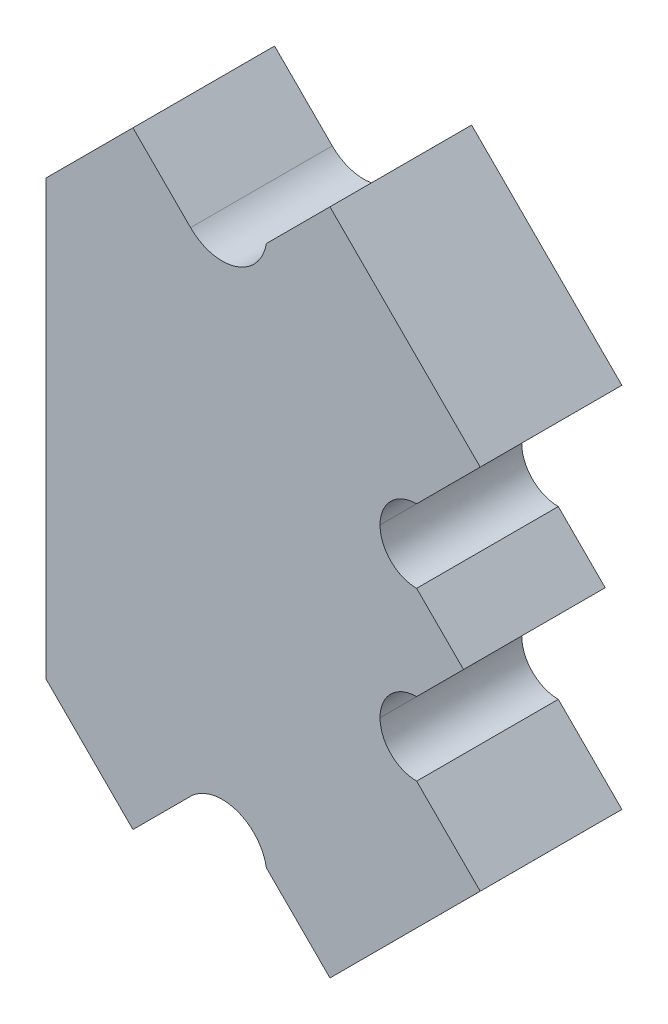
ISO-10303-21;
HEADER;
FILE_DESCRIPTION(('STEP AP214'),'2;1');
FILE_NAME('part.step','',(''),(''),'','','');
FILE_SCHEMA(('AUTOMOTIVE_DESIGN { 1 0 10303 214 1 1 1 1 }'));
ENDSEC;
DATA;
#1=APPLICATION_CONTEXT('core data for automotive mechanical design processes');
#2=APPLICATION_PROTOCOL_DEFINITION('international standard','automotive_design',2000,#1);
#3=PRODUCT_CONTEXT('',#1,'mechanical');
#4=PRODUCT('Part','Part','',(#3));
#5=PRODUCT_RELATED_PRODUCT_CATEGORY('part','',(#4));
#6=PRODUCT_DEFINITION_FORMATION('','',#4);
#7=PRODUCT_DEFINITION_CONTEXT('part definition',#1,'design');
#8=PRODUCT_DEFINITION('design','',#6,#7);
#9=PRODUCT_DEFINITION_SHAPE('','',#8);
#10=(LENGTH_UNIT() NAMED_UNIT(*) SI_UNIT(.MILLI.,.METRE.));
#11=(NAMED_UNIT(*) PLANE_ANGLE_UNIT() SI_UNIT($,.RADIAN.));
#12=(NAMED_UNIT(*) SI_UNIT($,.STERADIAN.) SOLID_ANGLE_UNIT());
#13=UNCERTAINTY_MEASURE_WITH_UNIT(LENGTH_MEASURE(1.E-05),#10,'distance_accuracy_value','');
#14=(GEOMETRIC_REPRESENTATION_CONTEXT(3) GLOBAL_UNCERTAINTY_ASSIGNED_CONTEXT((#13)) GLOBAL_UNIT_ASSIGNED_CONTEXT((#10,
#11,#12)) REPRESENTATION_CONTEXT('',''));
#15=CARTESIAN_POINT('',(0.,0.,0.));
#16=DIRECTION('',(0.,0.,1.));
#17=DIRECTION('',(1.,0.,0.));
#18=AXIS2_PLACEMENT_3D('',#15,#16,#17);
#19=CARTESIAN_POINT('',(2341.95158805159,77.6159460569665,6.));
#20=CARTESIAN_POINT('',(2341.5645384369,77.5498635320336,6.));
#21=CARTESIAN_POINT('',(2341.20755201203,77.3652451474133,6.));
#22=CARTESIAN_POINT('',(2340.9299222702,77.0875834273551,6.));
#23=B_SPLINE_CURVE_WITH_KNOTS('',3,(#19,#20,#21,#22),.UNSPECIFIED.,.F.,.F.,(4,4),(18.,19.),.UNSPECIFIED.);
#24=DIRECTION('',(0.,0.,-1.));
#25=VECTOR('',#24,1.);
#26=SURFACE_OF_LINEAR_EXTRUSION('',#23,#25);
#27=CARTESIAN_POINT('',(2341.95158805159,77.6159460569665,0.));
#28=CARTESIAN_POINT('',(2341.5645384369,77.5498635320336,0.));
#29=CARTESIAN_POINT('',(2341.20755201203,77.3652451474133,0.));
#30=CARTESIAN_POINT('',(2340.9299222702,77.0875834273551,0.));
#31=B_SPLINE_CURVE_WITH_KNOTS('',3,(#27,#28,#29,#30),.UNSPECIFIED.,.F.,.F.,(4,4),(18.,19.),.UNSPECIFIED.);
#32=CARTESIAN_POINT('',(2341.95158805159,77.6159460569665,0.));
#33=VERTEX_POINT('',#32);
#34=CARTESIAN_POINT('',(2340.9299222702,77.0875834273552,0.));
#35=VERTEX_POINT('',#34);
#36=EDGE_CURVE('E208',#33,#35,#31,.T.);
#37=ORIENTED_EDGE('',*,*,#36,.F.);
#38=DIRECTION('',(0.,0.,-1.));
#39=VECTOR('',#38,1.);
#40=CARTESIAN_POINT('',(2341.95158805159,77.6159460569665,6.));
#41=LINE('',#40,#39);
#42=CARTESIAN_POINT('',(2341.95158805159,77.6159460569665,6.));
#43=VERTEX_POINT('',#42);
#44=EDGE_CURVE('E11',#43,#33,#41,.T.);
#45=ORIENTED_EDGE('',*,*,#44,.F.);
#46=CARTESIAN_POINT('',(2340.9299222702,77.0875834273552,6.));
#47=VERTEX_POINT('',#46);
#48=EDGE_CURVE('E307',#43,#47,#23,.T.);
#49=ORIENTED_EDGE('',*,*,#48,.T.);
#50=DIRECTION('',(0.,0.,-1.));
#51=VECTOR('',#50,1.);
#52=CARTESIAN_POINT('',(2340.9299222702,77.0875834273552,6.));
#53=LINE('',#52,#51);
#54=EDGE_CURVE('E53',#47,#35,#53,.T.);
#55=ORIENTED_EDGE('',*,*,#54,.T.);
#56=EDGE_LOOP('',(#37,#45,#49,#55));
#57=FACE_BOUND('',#56,.T.);
#58=ADVANCED_FACE('F36',(#57),#26,.T.);
#59=CARTESIAN_POINT('',(2344.1396557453,76.0660720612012,6.));
#60=CARTESIAN_POINT('',(2343.96342342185,77.0982761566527,6.));
#61=CARTESIAN_POINT('',(2342.98379214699,77.7921783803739,6.));
#62=CARTESIAN_POINT('',(2341.95158805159,77.6159460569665,6.));
#63=B_SPLINE_CURVE_WITH_KNOTS('',3,(#59,#60,#61,#62),.UNSPECIFIED.,.F.,.F.,(4,4),(17.,18.),.UNSPECIFIED.);
#64=DIRECTION('',(0.,0.,-1.));
#65=VECTOR('',#64,1.);
#66=SURFACE_OF_LINEAR_EXTRUSION('',#63,#65);
#67=CARTESIAN_POINT('',(2344.1396557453,76.0660720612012,0.));
#68=CARTESIAN_POINT('',(2343.96342342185,77.0982761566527,0.));
#69=CARTESIAN_POINT('',(2342.98379214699,77.7921783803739,0.));
#70=CARTESIAN_POINT('',(2341.95158805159,77.6159460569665,0.));
#71=B_SPLINE_CURVE_WITH_KNOTS('',3,(#67,#68,#69,#70),.UNSPECIFIED.,.F.,.F.,(4,4),(17.,18.),.UNSPECIFIED.);
#72=CARTESIAN_POINT('',(2344.1396557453,76.0660720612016,0.));
#73=VERTEX_POINT('',#72);
#74=EDGE_CURVE('E212',#73,#33,#71,.T.);
#75=ORIENTED_EDGE('',*,*,#74,.F.);
#76=DIRECTION('',(0.,0.,-1.));
#77=VECTOR('',#76,1.);
#78=CARTESIAN_POINT('',(2344.1396557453,76.0660720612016,6.));
#79=LINE('',#78,#77);
#80=CARTESIAN_POINT('',(2344.1396557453,76.0660720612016,6.));
#81=VERTEX_POINT('',#80);
#82=EDGE_CURVE('E45',#81,#73,#79,.T.);
#83=ORIENTED_EDGE('',*,*,#82,.F.);
#84=EDGE_CURVE('E362',#81,#43,#63,.T.);
#85=ORIENTED_EDGE('',*,*,#84,.T.);
#86=ORIENTED_EDGE('',*,*,#44,.T.);
#87=EDGE_LOOP('',(#75,#83,#85,#86));
#88=FACE_BOUND('',#87,.T.);
#89=ADVANCED_FACE('F350',(#88),#66,.T.);
#90=CARTESIAN_POINT('',(1209.96786889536,1210.10723663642,6.));
#91=DIRECTION('',(-0.707066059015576,-0.70714750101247,0.));
#92=DIRECTION('',(0.70714750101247,-0.707066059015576,0.));
#93=AXIS2_PLACEMENT_3D('',#90,#91,#92);
#94=PLANE('',#93);
#95=DIRECTION('',(-0.70714750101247,0.707066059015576,0.));
#96=VECTOR('',#95,1.);
#97=CARTESIAN_POINT('',(1209.96786889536,1210.10723663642,0.));
#98=LINE('',#97,#96);
#99=CARTESIAN_POINT('',(2346.83245149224,73.373586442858,0.));
#100=VERTEX_POINT('',#99);
#101=EDGE_CURVE('E220',#100,#73,#98,.T.);
#102=ORIENTED_EDGE('',*,*,#101,.F.);
#103=DIRECTION('',(0.,0.,-1.));
#104=VECTOR('',#103,1.);
#105=CARTESIAN_POINT('',(2346.83245149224,73.373586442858,6.));
#106=LINE('',#105,#104);
#107=CARTESIAN_POINT('',(2346.83245149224,73.373586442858,6.));
#108=VERTEX_POINT('',#107);
#109=EDGE_CURVE('E339',#108,#100,#106,.T.);
#110=ORIENTED_EDGE('',*,*,#109,.F.);
#111=DIRECTION('',(-0.70714750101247,0.707066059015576,0.));
#112=VECTOR('',#111,1.);
#113=CARTESIAN_POINT('',(1209.96786889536,1210.10723663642,6.));
#114=LINE('',#113,#112);
#115=EDGE_CURVE('E346',#108,#81,#114,.T.);
#116=ORIENTED_EDGE('',*,*,#115,.T.);
#117=ORIENTED_EDGE('',*,*,#82,.T.);
#118=EDGE_LOOP('',(#102,#110,#116,#117));
#119=FACE_BOUND('',#118,.T.);
#120=ADVANCED_FACE('F344',(#119),#94,.T.);
#121=CARTESIAN_POINT('',(1136.86458259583,-1136.73365019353,6.));
#122=DIRECTION('',(0.707147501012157,-0.70706605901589,0.));
#123=DIRECTION('',(0.70706605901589,0.707147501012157,0.));
#124=AXIS2_PLACEMENT_3D('',#121,#122,#123);
#125=PLANE('',#124);
#126=DIRECTION('',(-0.70706605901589,-0.707147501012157,0.));
#127=VECTOR('',#126,1.);
#128=CARTESIAN_POINT('',(1136.86458259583,-1136.73365019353,0.));
#129=LINE('',#128,#127);
#130=CARTESIAN_POINT('',(2353.19604602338,79.7379139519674,0.));
#131=VERTEX_POINT('',#130);
#132=EDGE_CURVE('E226',#131,#100,#129,.T.);
#133=ORIENTED_EDGE('',*,*,#132,.F.);
#134=DIRECTION('',(0.,0.,-1.));
#135=VECTOR('',#134,1.);
#136=CARTESIAN_POINT('',(2353.19604602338,79.7379139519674,6.));
#137=LINE('',#136,#135);
#138=CARTESIAN_POINT('',(2353.19604602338,79.7379139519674,6.));
#139=VERTEX_POINT('',#138);
#140=EDGE_CURVE('E337',#139,#131,#137,.T.);
#141=ORIENTED_EDGE('',*,*,#140,.F.);
#142=DIRECTION('',(-0.70706605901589,-0.707147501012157,0.));
#143=VECTOR('',#142,1.);
#144=CARTESIAN_POINT('',(1136.86458259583,-1136.73365019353,6.));
#145=LINE('',#144,#143);
#146=EDGE_CURVE('E359',#139,#108,#145,.T.);
#147=ORIENTED_EDGE('',*,*,#146,.T.);
#148=ORIENTED_EDGE('',*,*,#109,.T.);
#149=EDGE_LOOP('',(#133,#141,#147,#148));
#150=FACE_BOUND('',#149,.T.);
#151=ADVANCED_FACE('F356',(#150),#125,.T.);
#152=CARTESIAN_POINT('',(1216.3314634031,1216.47156414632,6.));
#153=DIRECTION('',(0.707066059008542,0.707147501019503,0.));
#154=DIRECTION('',(-0.707147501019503,0.707066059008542,0.));
#155=AXIS2_PLACEMENT_3D('',#152,#153,#154);
#156=PLANE('',#155);
#157=DIRECTION('',(0.707147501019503,-0.707066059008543,0.));
#158=VECTOR('',#157,1.);
#159=CARTESIAN_POINT('',(1216.3314634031,1216.47156414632,0.));
#160=LINE('',#159,#158);
#161=CARTESIAN_POINT('',(2350.50325027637,82.4303995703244,0.));
#162=VERTEX_POINT('',#161);
#163=EDGE_CURVE('E229',#162,#131,#160,.T.);
#164=ORIENTED_EDGE('',*,*,#163,.F.);
#165=DIRECTION('',(0.,0.,-1.));
#166=VECTOR('',#165,1.);
#167=CARTESIAN_POINT('',(2350.50325027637,82.4303995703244,6.));
#168=LINE('',#167,#166);
#169=CARTESIAN_POINT('',(2350.50325027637,82.4303995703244,6.));
#170=VERTEX_POINT('',#169);
#171=EDGE_CURVE('E335',#170,#162,#168,.T.);
#172=ORIENTED_EDGE('',*,*,#171,.F.);
#173=DIRECTION('',(0.707147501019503,-0.707066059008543,0.));
#174=VECTOR('',#173,1.);
#175=CARTESIAN_POINT('',(1216.3314634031,1216.47156414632,6.));
#176=LINE('',#175,#174);
#177=EDGE_CURVE('E364',#170,#139,#176,.T.);
#178=ORIENTED_EDGE('',*,*,#177,.T.);
#179=ORIENTED_EDGE('',*,*,#140,.T.);
#180=EDGE_LOOP('',(#164,#172,#178,#179));
#181=FACE_BOUND('',#180,.T.);
#182=ADVANCED_FACE('F392',(#181),#156,.T.);
#183=CARTESIAN_POINT('',(2348.95316101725,83.9803103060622,6.));
#184=CARTESIAN_POINT('',(2348.95321031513,83.1242689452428,6.));
#185=CARTESIAN_POINT('',(2349.64720891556,82.430350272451,6.));
#186=CARTESIAN_POINT('',(2350.50325027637,82.4303995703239,6.));
#187=B_SPLINE_CURVE_WITH_KNOTS('',3,(#183,#184,#185,#186),.UNSPECIFIED.,.F.,.F.,(4,4),(13.,14.),.UNSPECIFIED.);
#188=DIRECTION('',(0.,0.,-1.));
#189=VECTOR('',#188,1.);
#190=SURFACE_OF_LINEAR_EXTRUSION('',#187,#189);
#191=CARTESIAN_POINT('',(2348.95316101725,83.9803103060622,0.));
#192=CARTESIAN_POINT('',(2348.95321031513,83.1242689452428,0.));
#193=CARTESIAN_POINT('',(2349.64720891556,82.430350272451,0.));
#194=CARTESIAN_POINT('',(2350.50325027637,82.4303995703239,0.));
#195=B_SPLINE_CURVE_WITH_KNOTS('',3,(#191,#192,#193,#194),.UNSPECIFIED.,.F.,.F.,(4,4),(13.,14.),.UNSPECIFIED.);
#196=CARTESIAN_POINT('',(2348.95316101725,83.9803103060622,0.));
#197=VERTEX_POINT('',#196);
#198=EDGE_CURVE('E232',#197,#162,#195,.T.);
#199=ORIENTED_EDGE('',*,*,#198,.F.);
#200=DIRECTION('',(0.,0.,-1.));
#201=VECTOR('',#200,1.);
#202=CARTESIAN_POINT('',(2348.95316101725,83.9803103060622,6.));
#203=LINE('',#202,#201);
#204=CARTESIAN_POINT('',(2348.95316101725,83.9803103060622,6.));
#205=VERTEX_POINT('',#204);
#206=EDGE_CURVE('E333',#205,#197,#203,.T.);
#207=ORIENTED_EDGE('',*,*,#206,.F.);
#208=EDGE_CURVE('E372',#205,#170,#187,.T.);
#209=ORIENTED_EDGE('',*,*,#208,.T.);
#210=ORIENTED_EDGE('',*,*,#171,.T.);
#211=EDGE_LOOP('',(#199,#207,#209,#210));
#212=FACE_BOUND('',#211,.T.);
#213=ADVANCED_FACE('F387',(#212),#190,.T.);
#214=CARTESIAN_POINT('',(2350.50307175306,85.5303995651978,6.));
#215=CARTESIAN_POINT('',(2349.64703039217,85.5303502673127,6.));
#216=CARTESIAN_POINT('',(2348.95311171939,84.8363516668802,6.));
#217=CARTESIAN_POINT('',(2348.95316101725,83.9803103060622,6.));
#218=B_SPLINE_CURVE_WITH_KNOTS('',3,(#214,#215,#216,#217),.UNSPECIFIED.,.F.,.F.,(4,4),(12.,13.),.UNSPECIFIED.);
#219=DIRECTION('',(0.,0.,-1.));
#220=VECTOR('',#219,1.);
#221=SURFACE_OF_LINEAR_EXTRUSION('',#218,#220);
#222=CARTESIAN_POINT('',(2350.50307175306,85.5303995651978,0.));
#223=CARTESIAN_POINT('',(2349.64703039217,85.5303502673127,0.));
#224=CARTESIAN_POINT('',(2348.95311171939,84.8363516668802,0.));
#225=CARTESIAN_POINT('',(2348.95316101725,83.9803103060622,0.));
#226=B_SPLINE_CURVE_WITH_KNOTS('',3,(#222,#223,#224,#225),.UNSPECIFIED.,.F.,.F.,(4,4),(12.,13.),.UNSPECIFIED.);
#227=CARTESIAN_POINT('',(2350.50307175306,85.5303995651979,0.));
#228=VERTEX_POINT('',#227);
#229=EDGE_CURVE('E237',#228,#197,#226,.T.);
#230=ORIENTED_EDGE('',*,*,#229,.F.);
#231=DIRECTION('',(0.,0.,-1.));
#232=VECTOR('',#231,1.);
#233=CARTESIAN_POINT('',(2350.50307175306,85.5303995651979,6.));
#234=LINE('',#233,#232);
#235=CARTESIAN_POINT('',(2350.50307175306,85.5303995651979,6.));
#236=VERTEX_POINT('',#235);
#237=EDGE_CURVE('E331',#236,#228,#234,.T.);
#238=ORIENTED_EDGE('',*,*,#237,.F.);
#239=EDGE_CURVE('E378',#236,#205,#218,.T.);
#240=ORIENTED_EDGE('',*,*,#239,.T.);
#241=ORIENTED_EDGE('',*,*,#206,.T.);
#242=EDGE_LOOP('',(#230,#238,#240,#241));
#243=FACE_BOUND('',#242,.T.);
#244=ADVANCED_FACE('F391',(#243),#221,.T.);
#245=CARTESIAN_POINT('',(1132.62169758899,-1132.49125383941,6.));
#246=DIRECTION('',(0.707147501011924,-0.707066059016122,0.));
#247=DIRECTION('',(0.707066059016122,0.707147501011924,0.));
#248=AXIS2_PLACEMENT_3D('',#245,#246,#247);
#249=PLANE('',#248);
#250=DIRECTION('',(-0.707066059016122,-0.707147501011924,0.));
#251=VECTOR('',#250,1.);
#252=CARTESIAN_POINT('',(1132.62169758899,-1132.49125383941,0.));
#253=LINE('',#252,#251);
#254=CARTESIAN_POINT('',(2352.48849131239,87.5160478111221,0.));
#255=VERTEX_POINT('',#254);
#256=EDGE_CURVE('E245',#255,#228,#253,.T.);
#257=ORIENTED_EDGE('',*,*,#256,.F.);
#258=DIRECTION('',(0.,0.,-1.));
#259=VECTOR('',#258,1.);
#260=CARTESIAN_POINT('',(2352.48849131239,87.5160478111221,6.));
#261=LINE('',#260,#259);
#262=CARTESIAN_POINT('',(2352.48849131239,87.5160478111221,6.));
#263=VERTEX_POINT('',#262);
#264=EDGE_CURVE('E329',#263,#255,#261,.T.);
#265=ORIENTED_EDGE('',*,*,#264,.F.);
#266=DIRECTION('',(-0.707066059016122,-0.707147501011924,0.));
#267=VECTOR('',#266,1.);
#268=CARTESIAN_POINT('',(1132.62169758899,-1132.49125383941,6.));
#269=LINE('',#268,#267);
#270=EDGE_CURVE('E500',#263,#236,#269,.T.);
#271=ORIENTED_EDGE('',*,*,#270,.T.);
#272=ORIENTED_EDGE('',*,*,#237,.T.);
#273=EDGE_LOOP('',(#257,#265,#271,#272));
#274=FACE_BOUND('',#273,.T.);
#275=ADVANCED_FACE('F497',(#274),#249,.T.);
#276=CARTESIAN_POINT('',(1219.86679369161,1220.00730165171,6.));
#277=DIRECTION('',(0.707066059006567,0.707147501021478,0.));
#278=DIRECTION('',(-0.707147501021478,0.707066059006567,0.));
#279=AXIS2_PLACEMENT_3D('',#276,#277,#278);
#280=PLANE('',#279);
#281=DIRECTION('',(0.707147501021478,-0.707066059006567,0.));
#282=VECTOR('',#281,1.);
#283=CARTESIAN_POINT('',(1219.86679369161,1220.00730165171,0.));
#284=LINE('',#283,#282);
#285=CARTESIAN_POINT('',(2350.5028430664,89.5014673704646,0.));
#286=VERTEX_POINT('',#285);
#287=EDGE_CURVE('E251',#286,#255,#284,.T.);
#288=ORIENTED_EDGE('',*,*,#287,.F.);
#289=DIRECTION('',(0.,0.,-1.));
#290=VECTOR('',#289,1.);
#291=CARTESIAN_POINT('',(2350.5028430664,89.5014673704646,6.));
#292=LINE('',#291,#290);
#293=CARTESIAN_POINT('',(2350.5028430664,89.5014673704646,6.));
#294=VERTEX_POINT('',#293);
#295=EDGE_CURVE('E327',#294,#286,#292,.T.);
#296=ORIENTED_EDGE('',*,*,#295,.F.);
#297=DIRECTION('',(0.707147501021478,-0.707066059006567,0.));
#298=VECTOR('',#297,1.);
#299=CARTESIAN_POINT('',(1219.86679369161,1220.00730165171,6.));
#300=LINE('',#299,#298);
#301=EDGE_CURVE('E506',#294,#263,#300,.T.);
#302=ORIENTED_EDGE('',*,*,#301,.T.);
#303=ORIENTED_EDGE('',*,*,#264,.T.);
#304=EDGE_LOOP('',(#288,#296,#302,#303));
#305=FACE_BOUND('',#304,.T.);
#306=ADVANCED_FACE('F493',(#305),#280,.T.);
#307=CARTESIAN_POINT('',(2348.95275380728,91.0513781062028,6.));
#308=CARTESIAN_POINT('',(2348.95280310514,90.1953367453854,6.));
#309=CARTESIAN_POINT('',(2349.64680170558,89.5014180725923,6.));
#310=CARTESIAN_POINT('',(2350.5028430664,89.5014673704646,6.));
#311=B_SPLINE_CURVE_WITH_KNOTS('',3,(#307,#308,#309,#310),.UNSPECIFIED.,.F.,.F.,(4,4),(9.,10.),.UNSPECIFIED.);
#312=DIRECTION('',(0.,0.,-1.));
#313=VECTOR('',#312,1.);
#314=SURFACE_OF_LINEAR_EXTRUSION('',#311,#313);
#315=CARTESIAN_POINT('',(2348.95275380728,91.0513781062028,0.));
#316=CARTESIAN_POINT('',(2348.95280310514,90.1953367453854,0.));
#317=CARTESIAN_POINT('',(2349.64680170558,89.5014180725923,0.));
#318=CARTESIAN_POINT('',(2350.5028430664,89.5014673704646,0.));
#319=B_SPLINE_CURVE_WITH_KNOTS('',3,(#315,#316,#317,#318),.UNSPECIFIED.,.F.,.F.,(4,4),(9.,10.),.UNSPECIFIED.);
#320=CARTESIAN_POINT('',(2348.95275380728,91.0513781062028,0.));
#321=VERTEX_POINT('',#320);
#322=EDGE_CURVE('E254',#321,#286,#319,.T.);
#323=ORIENTED_EDGE('',*,*,#322,.F.);
#324=DIRECTION('',(0.,0.,-1.));
#325=VECTOR('',#324,1.);
#326=CARTESIAN_POINT('',(2348.95275380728,91.0513781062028,6.));
#327=LINE('',#326,#325);
#328=CARTESIAN_POINT('',(2348.95275380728,91.0513781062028,6.));
#329=VERTEX_POINT('',#328);
#330=EDGE_CURVE('E325',#329,#321,#327,.T.);
#331=ORIENTED_EDGE('',*,*,#330,.F.);
#332=EDGE_CURVE('E489',#329,#294,#311,.T.);
#333=ORIENTED_EDGE('',*,*,#332,.T.);
#334=ORIENTED_EDGE('',*,*,#295,.T.);
#335=EDGE_LOOP('',(#323,#331,#333,#334));
#336=FACE_BOUND('',#335,.T.);
#337=ADVANCED_FACE('F487',(#336),#314,.T.);
#338=CARTESIAN_POINT('',(2350.50266454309,92.6014673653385,6.));
#339=CARTESIAN_POINT('',(2349.6466231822,92.601418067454,6.));
#340=CARTESIAN_POINT('',(2348.95270450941,91.9074194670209,6.));
#341=CARTESIAN_POINT('',(2348.95275380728,91.0513781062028,6.));
#342=B_SPLINE_CURVE_WITH_KNOTS('',3,(#338,#339,#340,#341),.UNSPECIFIED.,.F.,.F.,(4,4),(8.,9.),.UNSPECIFIED.);
#343=DIRECTION('',(0.,0.,-1.));
#344=VECTOR('',#343,1.);
#345=SURFACE_OF_LINEAR_EXTRUSION('',#342,#344);
#346=CARTESIAN_POINT('',(2350.50266454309,92.6014673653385,0.));
#347=CARTESIAN_POINT('',(2349.6466231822,92.601418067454,0.));
#348=CARTESIAN_POINT('',(2348.95270450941,91.9074194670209,0.));
#349=CARTESIAN_POINT('',(2348.95275380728,91.0513781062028,0.));
#350=B_SPLINE_CURVE_WITH_KNOTS('',3,(#346,#347,#348,#349),.UNSPECIFIED.,.F.,.F.,(4,4),(8.,9.),.UNSPECIFIED.);
#351=CARTESIAN_POINT('',(2350.50266454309,92.6014673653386,0.));
#352=VERTEX_POINT('',#351);
#353=EDGE_CURVE('E259',#352,#321,#350,.T.);
#354=ORIENTED_EDGE('',*,*,#353,.F.);
#355=DIRECTION('',(0.,0.,-1.));
#356=VECTOR('',#355,1.);
#357=CARTESIAN_POINT('',(2350.50266454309,92.6014673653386,6.));
#358=LINE('',#357,#356);
#359=CARTESIAN_POINT('',(2350.50266454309,92.6014673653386,6.));
#360=VERTEX_POINT('',#359);
#361=EDGE_CURVE('E323',#360,#352,#358,.T.);
#362=ORIENTED_EDGE('',*,*,#361,.F.);
#363=EDGE_CURVE('E483',#360,#329,#342,.T.);
#364=ORIENTED_EDGE('',*,*,#363,.T.);
#365=ORIENTED_EDGE('',*,*,#330,.T.);
#366=EDGE_LOOP('',(#354,#362,#364,#365));
#367=FACE_BOUND('',#366,.T.);
#368=ADVANCED_FACE('F480',(#367),#345,.T.);
#369=CARTESIAN_POINT('',(1129.08596008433,-1128.95592354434,6.));
#370=DIRECTION('',(0.707147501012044,-0.707066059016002,0.));
#371=DIRECTION('',(0.707066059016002,0.707147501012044,0.));
#372=AXIS2_PLACEMENT_3D('',#369,#370,#371);
#373=PLANE('',#372);
#374=DIRECTION('',(-0.707066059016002,-0.707147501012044,0.));
#375=VECTOR('',#374,1.);
#376=CARTESIAN_POINT('',(1129.08596008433,-1128.95592354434,0.));
#377=LINE('',#376,#375);
#378=CARTESIAN_POINT('',(2353.19515016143,95.2942631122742,0.));
#379=VERTEX_POINT('',#378);
#380=EDGE_CURVE('E267',#379,#352,#377,.T.);
#381=ORIENTED_EDGE('',*,*,#380,.F.);
#382=DIRECTION('',(0.,0.,-1.));
#383=VECTOR('',#382,1.);
#384=CARTESIAN_POINT('',(2353.19515016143,95.2942631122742,6.));
#385=LINE('',#384,#383);
#386=CARTESIAN_POINT('',(2353.19515016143,95.2942631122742,6.));
#387=VERTEX_POINT('',#386);
#388=EDGE_CURVE('E321',#387,#379,#385,.T.);
#389=ORIENTED_EDGE('',*,*,#388,.F.);
#390=DIRECTION('',(-0.707066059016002,-0.707147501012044,0.));
#391=VECTOR('',#390,1.);
#392=CARTESIAN_POINT('',(1129.08596008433,-1128.95592354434,6.));
#393=LINE('',#392,#391);
#394=EDGE_CURVE('E667',#387,#360,#393,.T.);
#395=ORIENTED_EDGE('',*,*,#394,.T.);
#396=ORIENTED_EDGE('',*,*,#361,.T.);
#397=EDGE_LOOP('',(#381,#389,#395,#396));
#398=FACE_BOUND('',#397,.T.);
#399=ADVANCED_FACE('F476',(#398),#373,.T.);
#400=CARTESIAN_POINT('',(1224.10919007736,1224.25018665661,6.));
#401=DIRECTION('',(0.707066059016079,0.707147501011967,0.));
#402=DIRECTION('',(-0.707147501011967,0.707066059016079,0.));
#403=AXIS2_PLACEMENT_3D('',#400,#401,#402);
#404=PLANE('',#403);
#405=DIRECTION('',(0.707147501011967,-0.707066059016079,0.));
#406=VECTOR('',#405,1.);
#407=CARTESIAN_POINT('',(1224.10919007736,1224.25018665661,0.));
#408=LINE('',#407,#406);
#409=CARTESIAN_POINT('',(2346.83082265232,101.657857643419,0.));
#410=VERTEX_POINT('',#409);
#411=EDGE_CURVE('E273',#410,#379,#408,.T.);
#412=ORIENTED_EDGE('',*,*,#411,.F.);
#413=DIRECTION('',(0.,0.,-1.));
#414=VECTOR('',#413,1.);
#415=CARTESIAN_POINT('',(2346.83082265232,101.657857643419,6.));
#416=LINE('',#415,#414);
#417=CARTESIAN_POINT('',(2346.83082265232,101.657857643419,6.));
#418=VERTEX_POINT('',#417);
#419=EDGE_CURVE('E319',#418,#410,#416,.T.);
#420=ORIENTED_EDGE('',*,*,#419,.F.);
#421=DIRECTION('',(0.707147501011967,-0.707066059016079,0.));
#422=VECTOR('',#421,1.);
#423=CARTESIAN_POINT('',(1224.10919007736,1224.25018665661,6.));
#424=LINE('',#423,#422);
#425=EDGE_CURVE('E472',#418,#387,#424,.T.);
#426=ORIENTED_EDGE('',*,*,#425,.T.);
#427=ORIENTED_EDGE('',*,*,#388,.T.);
#428=EDGE_LOOP('',(#412,#420,#426,#427));
#429=FACE_BOUND('',#428,.T.);
#430=ADVANCED_FACE('F470',(#429),#404,.T.);
#431=CARTESIAN_POINT('',(1122.72163257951,-1122.59232901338,6.));
#432=DIRECTION('',(-0.707147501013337,0.707066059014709,0.));
#433=DIRECTION('',(-0.707066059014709,-0.707147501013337,0.));
#434=AXIS2_PLACEMENT_3D('',#431,#432,#433);
#435=PLANE('',#434);
#436=DIRECTION('',(0.707066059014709,0.707147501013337,0.));
#437=VECTOR('',#436,1.);
#438=CARTESIAN_POINT('',(1122.72163257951,-1122.59232901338,0.));
#439=LINE('',#438,#437);
#440=CARTESIAN_POINT('',(2344.13833703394,98.9650618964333,0.));
#441=VERTEX_POINT('',#440);
#442=EDGE_CURVE('E276',#441,#410,#439,.T.);
#443=ORIENTED_EDGE('',*,*,#442,.F.);
#444=DIRECTION('',(0.,0.,-1.));
#445=VECTOR('',#444,1.);
#446=CARTESIAN_POINT('',(2344.13833703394,98.9650618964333,6.));
#447=LINE('',#446,#445);
#448=CARTESIAN_POINT('',(2344.13833703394,98.9650618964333,6.));
#449=VERTEX_POINT('',#448);
#450=EDGE_CURVE('E317',#449,#441,#447,.T.);
#451=ORIENTED_EDGE('',*,*,#450,.F.);
#452=DIRECTION('',(0.707066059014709,0.707147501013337,0.));
#453=VECTOR('',#452,1.);
#454=CARTESIAN_POINT('',(1122.72163257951,-1122.59232901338,6.));
#455=LINE('',#454,#453);
#456=EDGE_CURVE('E466',#449,#418,#455,.T.);
#457=ORIENTED_EDGE('',*,*,#456,.T.);
#458=ORIENTED_EDGE('',*,*,#419,.T.);
#459=EDGE_LOOP('',(#443,#451,#457,#458));
#460=FACE_BOUND('',#459,.T.);
#461=ADVANCED_FACE('F463',(#460),#435,.T.);
#462=CARTESIAN_POINT('',(2343.61009207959,97.9433352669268,6.));
#463=CARTESIAN_POINT('',(2343.88772182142,98.2209969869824,6.));
#464=CARTESIAN_POINT('',(2344.07229908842,98.5780046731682,6.));
#465=CARTESIAN_POINT('',(2344.13833703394,98.9650618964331,6.));
#466=B_SPLINE_CURVE_WITH_KNOTS('',3,(#462,#463,#464,#465),.UNSPECIFIED.,.F.,.F.,(4,4),(4.,5.),.UNSPECIFIED.);
#467=DIRECTION('',(0.,0.,-1.));
#468=VECTOR('',#467,1.);
#469=SURFACE_OF_LINEAR_EXTRUSION('',#466,#468);
#470=CARTESIAN_POINT('',(2343.61009207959,97.9433352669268,0.));
#471=CARTESIAN_POINT('',(2343.88772182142,98.2209969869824,0.));
#472=CARTESIAN_POINT('',(2344.07229908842,98.5780046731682,0.));
#473=CARTESIAN_POINT('',(2344.13833703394,98.9650618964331,0.));
#474=B_SPLINE_CURVE_WITH_KNOTS('',3,(#470,#471,#472,#473),.UNSPECIFIED.,.F.,.F.,(4,4),(4.,5.),.UNSPECIFIED.);
#475=CARTESIAN_POINT('',(2343.61009207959,97.9433352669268,0.));
#476=VERTEX_POINT('',#475);
#477=EDGE_CURVE('E279',#476,#441,#474,.T.);
#478=ORIENTED_EDGE('',*,*,#477,.F.);
#479=DIRECTION('',(0.,0.,-1.));
#480=VECTOR('',#479,1.);
#481=CARTESIAN_POINT('',(2343.61009207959,97.9433352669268,6.));
#482=LINE('',#481,#480);
#483=CARTESIAN_POINT('',(2343.61009207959,97.9433352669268,6.));
#484=VERTEX_POINT('',#483);
#485=EDGE_CURVE('E315',#484,#476,#482,.T.);
#486=ORIENTED_EDGE('',*,*,#485,.F.);
#487=EDGE_CURVE('E443',#484,#449,#466,.T.);
#488=ORIENTED_EDGE('',*,*,#487,.T.);
#489=ORIENTED_EDGE('',*,*,#450,.T.);
#490=EDGE_LOOP('',(#478,#486,#488,#489));
#491=FACE_BOUND('',#490,.T.);
#492=ADVANCED_FACE('F432',(#491),#469,.T.);
#493=CARTESIAN_POINT('',(2340.92872123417,97.9431808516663,6.));
#494=CARTESIAN_POINT('',(2341.66920398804,97.2027833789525,6.));
#495=CARTESIAN_POINT('',(2342.86969460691,97.2028525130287,6.));
#496=CARTESIAN_POINT('',(2343.61009207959,97.9433352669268,6.));
#497=B_SPLINE_CURVE_WITH_KNOTS('',3,(#493,#494,#495,#496),.UNSPECIFIED.,.F.,.F.,(4,4),(3.,4.),.UNSPECIFIED.);
#498=DIRECTION('',(0.,0.,-1.));
#499=VECTOR('',#498,1.);
#500=SURFACE_OF_LINEAR_EXTRUSION('',#497,#499);
#501=CARTESIAN_POINT('',(2340.92872123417,97.9431808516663,0.));
#502=CARTESIAN_POINT('',(2341.66920398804,97.2027833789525,0.));
#503=CARTESIAN_POINT('',(2342.86969460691,97.2028525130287,0.));
#504=CARTESIAN_POINT('',(2343.61009207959,97.9433352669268,0.));
#505=B_SPLINE_CURVE_WITH_KNOTS('',3,(#501,#502,#503,#504),.UNSPECIFIED.,.F.,.F.,(4,4),(3.,4.),.UNSPECIFIED.);
#506=CARTESIAN_POINT('',(2340.92872123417,97.9431808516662,0.));
#507=VERTEX_POINT('',#506);
#508=EDGE_CURVE('E284',#507,#476,#505,.T.);
#509=ORIENTED_EDGE('',*,*,#508,.F.);
#510=DIRECTION('',(0.,0.,-1.));
#511=VECTOR('',#510,1.);
#512=CARTESIAN_POINT('',(2340.92872123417,97.9431808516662,6.));
#513=LINE('',#512,#511);
#514=CARTESIAN_POINT('',(2340.92872123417,97.9431808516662,6.));
#515=VERTEX_POINT('',#514);
#516=EDGE_CURVE('E313',#515,#507,#513,.T.);
#517=ORIENTED_EDGE('',*,*,#516,.F.);
#518=EDGE_CURVE('E436',#515,#484,#497,.T.);
#519=ORIENTED_EDGE('',*,*,#518,.T.);
#520=ORIENTED_EDGE('',*,*,#485,.T.);
#521=EDGE_LOOP('',(#509,#517,#519,#520));
#522=FACE_BOUND('',#521,.T.);
#523=ADVANCED_FACE('F427',(#522),#500,.T.);
#524=CARTESIAN_POINT('',(1219.30114087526,1219.44158364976,6.));
#525=DIRECTION('',(0.707066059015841,0.707147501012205,0.));
#526=DIRECTION('',(-0.707147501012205,0.707066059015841,0.));
#527=AXIS2_PLACEMENT_3D('',#524,#525,#526);
#528=PLANE('',#527);
#529=DIRECTION('',(0.707147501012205,-0.707066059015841,0.));
#530=VECTOR('',#529,1.);
#531=CARTESIAN_POINT('',(1219.30114087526,1219.44158364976,0.));
#532=LINE('',#531,#530);
#533=CARTESIAN_POINT('',(2338.48703594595,100.38458493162,0.));
#534=VERTEX_POINT('',#533);
#535=EDGE_CURVE('E292',#534,#507,#532,.T.);
#536=ORIENTED_EDGE('',*,*,#535,.F.);
#537=DIRECTION('',(0.,0.,-1.));
#538=VECTOR('',#537,1.);
#539=CARTESIAN_POINT('',(2338.48703594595,100.38458493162,6.));
#540=LINE('',#539,#538);
#541=CARTESIAN_POINT('',(2338.48703594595,100.38458493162,6.));
#542=VERTEX_POINT('',#541);
#543=EDGE_CURVE('E311',#542,#534,#540,.T.);
#544=ORIENTED_EDGE('',*,*,#543,.F.);
#545=DIRECTION('',(0.707147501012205,-0.707066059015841,0.));
#546=VECTOR('',#545,1.);
#547=CARTESIAN_POINT('',(1219.30114087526,1219.44158364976,6.));
#548=LINE('',#547,#546);
#549=EDGE_CURVE('E442',#542,#515,#548,.T.);
#550=ORIENTED_EDGE('',*,*,#549,.T.);
#551=ORIENTED_EDGE('',*,*,#516,.T.);
#552=EDGE_LOOP('',(#536,#544,#550,#551));
#553=FACE_BOUND('',#552,.T.);
#554=ADVANCED_FACE('F423',(#553),#528,.T.);
#555=CARTESIAN_POINT('',(1119.1858950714,-1119.05699871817,6.));
#556=DIRECTION('',(-0.707147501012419,0.707066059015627,0.));
#557=DIRECTION('',(-0.707066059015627,-0.707147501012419,0.));
#558=AXIS2_PLACEMENT_3D('',#555,#556,#557);
#559=PLANE('',#558);
#560=DIRECTION('',(0.707066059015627,0.70714750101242,0.));
#561=VECTOR('',#560,1.);
#562=CARTESIAN_POINT('',(1119.1858950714,-1119.05699871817,0.));
#563=LINE('',#562,#561);
#564=CARTESIAN_POINT('',(2334.81029243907,96.7074179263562,0.));
#565=VERTEX_POINT('',#564);
#566=EDGE_CURVE('E298',#565,#534,#563,.T.);
#567=ORIENTED_EDGE('',*,*,#566,.F.);
#568=DIRECTION('',(0.,0.,-1.));
#569=VECTOR('',#568,1.);
#570=CARTESIAN_POINT('',(2334.81029243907,96.7074179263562,6.));
#571=LINE('',#570,#569);
#572=CARTESIAN_POINT('',(2334.81029243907,96.7074179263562,6.));
#573=VERTEX_POINT('',#572);
#574=EDGE_CURVE('E190',#573,#565,#571,.T.);
#575=ORIENTED_EDGE('',*,*,#574,.F.);
#576=DIRECTION('',(0.707066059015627,0.70714750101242,0.));
#577=VECTOR('',#576,1.);
#578=CARTESIAN_POINT('',(1119.1858950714,-1119.05699871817,6.));
#579=LINE('',#578,#577);
#580=EDGE_CURVE('E200',#573,#542,#579,.T.);
#581=ORIENTED_EDGE('',*,*,#580,.T.);
#582=ORIENTED_EDGE('',*,*,#543,.T.);
#583=EDGE_LOOP('',(#567,#575,#581,#582));
#584=FACE_BOUND('',#583,.T.);
#585=ADVANCED_FACE('F420',(#584),#559,.T.);
#586=CARTESIAN_POINT('',(2334.8158539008,0.134457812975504,6.));
#587=DIRECTION('',(-0.9999999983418,-5.75881873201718E-05,0.));
#588=DIRECTION('',(5.75881873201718E-05,-0.9999999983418,0.));
#589=AXIS2_PLACEMENT_3D('',#586,#587,#588);
#590=PLANE('',#589);
#591=DIRECTION('',(-5.75881873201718E-05,0.9999999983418,0.));
#592=VECTOR('',#591,1.);
#593=CARTESIAN_POINT('',(2334.8158539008,0.134457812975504,0.));
#594=LINE('',#593,#592);
#595=CARTESIAN_POINT('',(2334.81135118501,78.3226416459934,0.));
#596=VERTEX_POINT('',#595);
#597=EDGE_CURVE('E186',#596,#565,#594,.T.);
#598=ORIENTED_EDGE('',*,*,#597,.F.);
#599=DIRECTION('',(0.,0.,-1.));
#600=VECTOR('',#599,1.);
#601=CARTESIAN_POINT('',(2334.81135118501,78.3226416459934,6.));
#602=LINE('',#601,#600);
#603=CARTESIAN_POINT('',(2334.81135118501,78.3226416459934,6.));
#604=VERTEX_POINT('',#603);
#605=EDGE_CURVE('E181',#604,#596,#602,.T.);
#606=ORIENTED_EDGE('',*,*,#605,.F.);
#607=DIRECTION('',(-5.75881873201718E-05,0.9999999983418,0.));
#608=VECTOR('',#607,1.);
#609=CARTESIAN_POINT('',(2334.8158539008,0.134457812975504,6.));
#610=LINE('',#609,#608);
#611=EDGE_CURVE('E184',#604,#573,#610,.T.);
#612=ORIENTED_EDGE('',*,*,#611,.T.);
#613=ORIENTED_EDGE('',*,*,#574,.T.);
#614=EDGE_LOOP('',(#598,#606,#612,#613));
#615=FACE_BOUND('',#614,.T.);
#616=ADVANCED_FACE('F183',(#615),#590,.T.);
#617=CARTESIAN_POINT('',(1206.4325386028,1206.57149913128,6.));
#618=DIRECTION('',(-0.707066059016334,-0.707147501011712,0.));
#619=DIRECTION('',(0.707147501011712,-0.707066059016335,0.));
#620=AXIS2_PLACEMENT_3D('',#617,#618,#619);
#621=PLANE('',#620);
#622=DIRECTION('',(-0.707147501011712,0.707066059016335,0.));
#623=VECTOR('',#622,1.);
#624=CARTESIAN_POINT('',(1206.4325386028,1206.57149913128,0.));
#625=LINE('',#624,#623);
#626=CARTESIAN_POINT('',(2338.48851819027,74.6458981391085,0.));
#627=VERTEX_POINT('',#626);
#628=EDGE_CURVE('E302',#627,#596,#625,.T.);
#629=ORIENTED_EDGE('',*,*,#628,.F.);
#630=DIRECTION('',(0.,0.,-1.));
#631=VECTOR('',#630,1.);
#632=CARTESIAN_POINT('',(2338.48851819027,74.6458981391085,6.));
#633=LINE('',#632,#631);
#634=CARTESIAN_POINT('',(2338.48851819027,74.6458981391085,6.));
#635=VERTEX_POINT('',#634);
#636=EDGE_CURVE('E117',#635,#627,#633,.T.);
#637=ORIENTED_EDGE('',*,*,#636,.F.);
#638=DIRECTION('',(-0.707147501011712,0.707066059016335,0.));
#639=VECTOR('',#638,1.);
#640=CARTESIAN_POINT('',(1206.4325386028,1206.57149913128,6.));
#641=LINE('',#640,#639);
#642=EDGE_CURVE('E197',#635,#604,#641,.T.);
#643=ORIENTED_EDGE('',*,*,#642,.T.);
#644=ORIENTED_EDGE('',*,*,#605,.T.);
#645=EDGE_LOOP('',(#629,#637,#643,#644));
#646=FACE_BOUND('',#645,.T.);
#647=ADVANCED_FACE('F202',(#646),#621,.T.);
#648=CARTESIAN_POINT('',(1132.05597961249,-1131.92560099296,6.));
#649=DIRECTION('',(0.707147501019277,-0.707066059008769,0.));
#650=DIRECTION('',(0.707066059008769,0.707147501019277,0.));
#651=AXIS2_PLACEMENT_3D('',#648,#649,#650);
#652=PLANE('',#651);
#653=DIRECTION('',(-0.707066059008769,-0.707147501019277,0.));
#654=VECTOR('',#653,1.);
#655=CARTESIAN_POINT('',(1132.05597961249,-1131.92560099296,0.));
#656=LINE('',#655,#654);
#657=EDGE_CURVE('E304',#35,#627,#656,.T.);
#658=ORIENTED_EDGE('',*,*,#657,.F.);
#659=ORIENTED_EDGE('',*,*,#54,.F.);
#660=DIRECTION('',(-0.707066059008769,-0.707147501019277,0.));
#661=VECTOR('',#660,1.);
#662=CARTESIAN_POINT('',(1132.05597961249,-1131.92560099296,6.));
#663=LINE('',#662,#661);
#664=EDGE_CURVE('E203',#47,#635,#663,.T.);
#665=ORIENTED_EDGE('',*,*,#664,.T.);
#666=ORIENTED_EDGE('',*,*,#636,.T.);
#667=EDGE_LOOP('',(#658,#659,#665,#666));
#668=FACE_BOUND('',#667,.T.);
#669=ADVANCED_FACE('F407',(#668),#652,.T.);
#670=CARTESIAN_POINT('',(0.,0.,6.));
#671=DIRECTION('',(0.,0.,1.));
#672=DIRECTION('',(1.,0.,0.));
#673=AXIS2_PLACEMENT_3D('',#670,#671,#672);
#674=PLANE('',#673);
#675=ORIENTED_EDGE('',*,*,#48,.F.);
#676=ORIENTED_EDGE('',*,*,#84,.F.);
#677=ORIENTED_EDGE('',*,*,#115,.F.);
#678=ORIENTED_EDGE('',*,*,#146,.F.);
#679=ORIENTED_EDGE('',*,*,#177,.F.);
#680=ORIENTED_EDGE('',*,*,#208,.F.);
#681=ORIENTED_EDGE('',*,*,#239,.F.);
#682=ORIENTED_EDGE('',*,*,#270,.F.);
#683=ORIENTED_EDGE('',*,*,#301,.F.);
#684=ORIENTED_EDGE('',*,*,#332,.F.);
#685=ORIENTED_EDGE('',*,*,#363,.F.);
#686=ORIENTED_EDGE('',*,*,#394,.F.);
#687=ORIENTED_EDGE('',*,*,#425,.F.);
#688=ORIENTED_EDGE('',*,*,#456,.F.);
#689=ORIENTED_EDGE('',*,*,#487,.F.);
#690=ORIENTED_EDGE('',*,*,#518,.F.);
#691=ORIENTED_EDGE('',*,*,#549,.F.);
#692=ORIENTED_EDGE('',*,*,#580,.F.);
#693=ORIENTED_EDGE('',*,*,#611,.F.);
#694=ORIENTED_EDGE('',*,*,#642,.F.);
#695=ORIENTED_EDGE('',*,*,#664,.F.);
#696=EDGE_LOOP('',(#675,#676,#677,#678,#679,#680,#681,#682,#683,#684,#685,#686,#687,#688,#689,
#690,#691,#692,#693,#694,#695));
#697=FACE_BOUND('',#696,.T.);
#698=ADVANCED_FACE('F195',(#697),#674,.T.);
#699=CARTESIAN_POINT('',(0.,0.,0.));
#700=DIRECTION('',(0.,0.,1.));
#701=DIRECTION('',(1.,0.,0.));
#702=AXIS2_PLACEMENT_3D('',#699,#700,#701);
#703=PLANE('',#702);
#704=ORIENTED_EDGE('',*,*,#36,.T.);
#705=ORIENTED_EDGE('',*,*,#657,.T.);
#706=ORIENTED_EDGE('',*,*,#628,.T.);
#707=ORIENTED_EDGE('',*,*,#597,.T.);
#708=ORIENTED_EDGE('',*,*,#566,.T.);
#709=ORIENTED_EDGE('',*,*,#535,.T.);
#710=ORIENTED_EDGE('',*,*,#508,.T.);
#711=ORIENTED_EDGE('',*,*,#477,.T.);
#712=ORIENTED_EDGE('',*,*,#442,.T.);
#713=ORIENTED_EDGE('',*,*,#411,.T.);
#714=ORIENTED_EDGE('',*,*,#380,.T.);
#715=ORIENTED_EDGE('',*,*,#353,.T.);
#716=ORIENTED_EDGE('',*,*,#322,.T.);
#717=ORIENTED_EDGE('',*,*,#287,.T.);
#718=ORIENTED_EDGE('',*,*,#256,.T.);
#719=ORIENTED_EDGE('',*,*,#229,.T.);
#720=ORIENTED_EDGE('',*,*,#198,.T.);
#721=ORIENTED_EDGE('',*,*,#163,.T.);
#722=ORIENTED_EDGE('',*,*,#132,.T.);
#723=ORIENTED_EDGE('',*,*,#101,.T.);
#724=ORIENTED_EDGE('',*,*,#74,.T.);
#725=EDGE_LOOP('',(#704,#705,#706,#707,#708,#709,#710,#711,#712,#713,#714,#715,#716,#717,#718,
#719,#720,#721,#722,#723,#724));
#726=FACE_BOUND('',#725,.T.);
#727=ADVANCED_FACE('F352',(#726),#703,.F.);
#728=CLOSED_SHELL('',(#58,#89,#120,#151,#182,#213,#244,#275,#306,#337,#368,#399,#430,#461,#492,
#523,#554,#585,#616,#647,#669,#698,#727));
#729=MANIFOLD_SOLID_BREP('B2',#728);
#730=ADVANCED_BREP_SHAPE_REPRESENTATION('',(#18,#729),#14);
#731=SHAPE_DEFINITION_REPRESENTATION(#9,#730);
ENDSEC;
END-ISO-10303-21;
